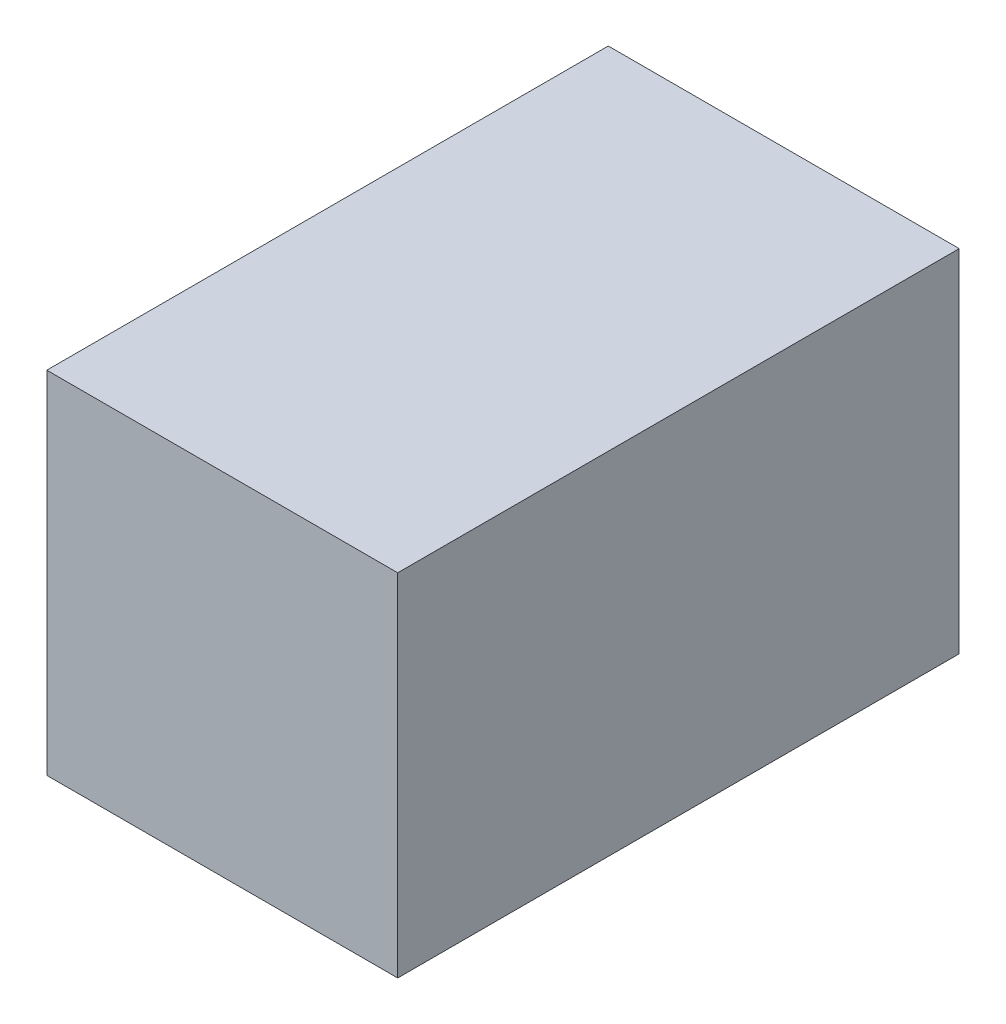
ISO-10303-21;
HEADER;
FILE_DESCRIPTION(('STEP AP214'),'2;1');
FILE_NAME('part.step','',(''),(''),'','','');
FILE_SCHEMA(('AUTOMOTIVE_DESIGN { 1 0 10303 214 1 1 1 1 }'));
ENDSEC;
DATA;
#1=APPLICATION_CONTEXT('core data for automotive mechanical design processes');
#2=APPLICATION_PROTOCOL_DEFINITION('international standard','automotive_design',2000,#1);
#3=PRODUCT_CONTEXT('',#1,'mechanical');
#4=PRODUCT('Part','Part','',(#3));
#5=PRODUCT_RELATED_PRODUCT_CATEGORY('part','',(#4));
#6=PRODUCT_DEFINITION_FORMATION('','',#4);
#7=PRODUCT_DEFINITION_CONTEXT('part definition',#1,'design');
#8=PRODUCT_DEFINITION('design','',#6,#7);
#9=PRODUCT_DEFINITION_SHAPE('','',#8);
#10=(LENGTH_UNIT() NAMED_UNIT(*) SI_UNIT(.MILLI.,.METRE.));
#11=(NAMED_UNIT(*) PLANE_ANGLE_UNIT() SI_UNIT($,.RADIAN.));
#12=(NAMED_UNIT(*) SI_UNIT($,.STERADIAN.) SOLID_ANGLE_UNIT());
#13=UNCERTAINTY_MEASURE_WITH_UNIT(LENGTH_MEASURE(1.E-05),#10,'distance_accuracy_value','');
#14=(GEOMETRIC_REPRESENTATION_CONTEXT(3) GLOBAL_UNCERTAINTY_ASSIGNED_CONTEXT((#13)) GLOBAL_UNIT_ASSIGNED_CONTEXT((#10,
#11,#12)) REPRESENTATION_CONTEXT('',''));
#15=CARTESIAN_POINT('',(0.,0.,0.));
#16=DIRECTION('',(0.,0.,1.));
#17=DIRECTION('',(1.,0.,0.));
#18=AXIS2_PLACEMENT_3D('',#15,#16,#17);
#19=CARTESIAN_POINT('',(-1.190625,1.190625,3.81));
#20=DIRECTION('',(1.,0.,0.));
#21=DIRECTION('',(0.,1.,0.));
#22=AXIS2_PLACEMENT_3D('',#19,#20,#21);
#23=PLANE('',#22);
#24=DIRECTION('',(0.,-1.,0.));
#25=VECTOR('',#24,1.);
#26=CARTESIAN_POINT('',(-1.190625,1.190625,0.));
#27=LINE('',#26,#25);
#28=CARTESIAN_POINT('',(-1.190625,1.190625,0.));
#29=VERTEX_POINT('',#28);
#30=CARTESIAN_POINT('',(-1.190625,-1.190625,0.));
#31=VERTEX_POINT('',#30);
#32=EDGE_CURVE('E96',#29,#31,#27,.T.);
#33=ORIENTED_EDGE('',*,*,#32,.T.);
#34=DIRECTION('',(0.,0.,-1.));
#35=VECTOR('',#34,1.);
#36=CARTESIAN_POINT('',(-1.190625,-1.190625,3.81));
#37=LINE('',#36,#35);
#38=CARTESIAN_POINT('',(-1.190625,-1.190625,3.81));
#39=VERTEX_POINT('',#38);
#40=EDGE_CURVE('E11',#39,#31,#37,.T.);
#41=ORIENTED_EDGE('',*,*,#40,.F.);
#42=DIRECTION('',(0.,-1.,0.));
#43=VECTOR('',#42,1.);
#44=CARTESIAN_POINT('',(-1.190625,1.190625,3.81));
#45=LINE('',#44,#43);
#46=CARTESIAN_POINT('',(-1.190625,1.190625,3.81));
#47=VERTEX_POINT('',#46);
#48=EDGE_CURVE('E84',#47,#39,#45,.T.);
#49=ORIENTED_EDGE('',*,*,#48,.F.);
#50=DIRECTION('',(0.,0.,-1.));
#51=VECTOR('',#50,1.);
#52=CARTESIAN_POINT('',(-1.190625,1.190625,3.81));
#53=LINE('',#52,#51);
#54=EDGE_CURVE('E92',#47,#29,#53,.T.);
#55=ORIENTED_EDGE('',*,*,#54,.T.);
#56=EDGE_LOOP('',(#33,#41,#49,#55));
#57=FACE_BOUND('',#56,.T.);
#58=ADVANCED_FACE('F33',(#57),#23,.F.);
#59=CARTESIAN_POINT('',(-1.190625,-1.190625,3.81));
#60=DIRECTION('',(0.,1.,0.));
#61=DIRECTION('',(0.,0.,1.));
#62=AXIS2_PLACEMENT_3D('',#59,#60,#61);
#63=PLANE('',#62);
#64=DIRECTION('',(1.,0.,0.));
#65=VECTOR('',#64,1.);
#66=CARTESIAN_POINT('',(-1.190625,-1.190625,0.));
#67=LINE('',#66,#65);
#68=CARTESIAN_POINT('',(1.190625,-1.190625,0.));
#69=VERTEX_POINT('',#68);
#70=EDGE_CURVE('E88',#31,#69,#67,.T.);
#71=ORIENTED_EDGE('',*,*,#70,.T.);
#72=DIRECTION('',(0.,0.,-1.));
#73=VECTOR('',#72,1.);
#74=CARTESIAN_POINT('',(1.190625,-1.190625,3.81));
#75=LINE('',#74,#73);
#76=CARTESIAN_POINT('',(1.190625,-1.190625,3.81));
#77=VERTEX_POINT('',#76);
#78=EDGE_CURVE('E41',#77,#69,#75,.T.);
#79=ORIENTED_EDGE('',*,*,#78,.F.);
#80=DIRECTION('',(1.,0.,0.));
#81=VECTOR('',#80,1.);
#82=CARTESIAN_POINT('',(-1.190625,-1.190625,3.81));
#83=LINE('',#82,#81);
#84=EDGE_CURVE('E79',#39,#77,#83,.T.);
#85=ORIENTED_EDGE('',*,*,#84,.F.);
#86=ORIENTED_EDGE('',*,*,#40,.T.);
#87=EDGE_LOOP('',(#71,#79,#85,#86));
#88=FACE_BOUND('',#87,.T.);
#89=ADVANCED_FACE('F87',(#88),#63,.F.);
#90=CARTESIAN_POINT('',(1.190625,1.190625,3.81));
#91=DIRECTION('',(-1.,0.,0.));
#92=DIRECTION('',(0.,-1.,0.));
#93=AXIS2_PLACEMENT_3D('',#90,#91,#92);
#94=PLANE('',#93);
#95=DIRECTION('',(0.,1.,0.));
#96=VECTOR('',#95,1.);
#97=CARTESIAN_POINT('',(1.190625,1.190625,0.));
#98=LINE('',#97,#96);
#99=CARTESIAN_POINT('',(1.190625,1.190625,0.));
#100=VERTEX_POINT('',#99);
#101=EDGE_CURVE('E66',#69,#100,#98,.T.);
#102=ORIENTED_EDGE('',*,*,#101,.T.);
#103=DIRECTION('',(0.,0.,-1.));
#104=VECTOR('',#103,1.);
#105=CARTESIAN_POINT('',(1.190625,1.190625,3.81));
#106=LINE('',#105,#104);
#107=CARTESIAN_POINT('',(1.190625,1.190625,3.81));
#108=VERTEX_POINT('',#107);
#109=EDGE_CURVE('E89',#108,#100,#106,.T.);
#110=ORIENTED_EDGE('',*,*,#109,.F.);
#111=DIRECTION('',(0.,1.,0.));
#112=VECTOR('',#111,1.);
#113=CARTESIAN_POINT('',(1.190625,1.190625,3.81));
#114=LINE('',#113,#112);
#115=EDGE_CURVE('E82',#77,#108,#114,.T.);
#116=ORIENTED_EDGE('',*,*,#115,.F.);
#117=ORIENTED_EDGE('',*,*,#78,.T.);
#118=EDGE_LOOP('',(#102,#110,#116,#117));
#119=FACE_BOUND('',#118,.T.);
#120=ADVANCED_FACE('F90',(#119),#94,.F.);
#121=CARTESIAN_POINT('',(-1.190625,1.190625,3.81));
#122=DIRECTION('',(0.,-1.,0.));
#123=DIRECTION('',(0.,0.,-1.));
#124=AXIS2_PLACEMENT_3D('',#121,#122,#123);
#125=PLANE('',#124);
#126=DIRECTION('',(-1.,0.,0.));
#127=VECTOR('',#126,1.);
#128=CARTESIAN_POINT('',(-1.190625,1.190625,0.));
#129=LINE('',#128,#127);
#130=EDGE_CURVE('E72',#100,#29,#129,.T.);
#131=ORIENTED_EDGE('',*,*,#130,.T.);
#132=ORIENTED_EDGE('',*,*,#54,.F.);
#133=DIRECTION('',(-1.,0.,0.));
#134=VECTOR('',#133,1.);
#135=CARTESIAN_POINT('',(-1.190625,1.190625,3.81));
#136=LINE('',#135,#134);
#137=EDGE_CURVE('E49',#108,#47,#136,.T.);
#138=ORIENTED_EDGE('',*,*,#137,.F.);
#139=ORIENTED_EDGE('',*,*,#109,.T.);
#140=EDGE_LOOP('',(#131,#132,#138,#139));
#141=FACE_BOUND('',#140,.T.);
#142=ADVANCED_FACE('F103',(#141),#125,.F.);
#143=CARTESIAN_POINT('',(-1.190625,-1.190625,3.81));
#144=DIRECTION('',(0.,0.,1.));
#145=DIRECTION('',(1.,0.,0.));
#146=AXIS2_PLACEMENT_3D('',#143,#144,#145);
#147=PLANE('',#146);
#148=ORIENTED_EDGE('',*,*,#48,.T.);
#149=ORIENTED_EDGE('',*,*,#84,.T.);
#150=ORIENTED_EDGE('',*,*,#115,.T.);
#151=ORIENTED_EDGE('',*,*,#137,.T.);
#152=EDGE_LOOP('',(#148,#149,#150,#151));
#153=FACE_BOUND('',#152,.T.);
#154=ADVANCED_FACE('F80',(#153),#147,.T.);
#155=CARTESIAN_POINT('',(-1.190625,-1.190625,0.));
#156=DIRECTION('',(0.,0.,1.));
#157=DIRECTION('',(1.,0.,0.));
#158=AXIS2_PLACEMENT_3D('',#155,#156,#157);
#159=PLANE('',#158);
#160=ORIENTED_EDGE('',*,*,#32,.F.);
#161=ORIENTED_EDGE('',*,*,#130,.F.);
#162=ORIENTED_EDGE('',*,*,#101,.F.);
#163=ORIENTED_EDGE('',*,*,#70,.F.);
#164=EDGE_LOOP('',(#160,#161,#162,#163));
#165=FACE_BOUND('',#164,.T.);
#166=ADVANCED_FACE('F106',(#165),#159,.F.);
#167=CLOSED_SHELL('',(#58,#89,#120,#142,#154,#166));
#168=MANIFOLD_SOLID_BREP('B2',#167);
#169=ADVANCED_BREP_SHAPE_REPRESENTATION('',(#18,#168),#14);
#170=SHAPE_DEFINITION_REPRESENTATION(#9,#169);
ENDSEC;
END-ISO-10303-21;
